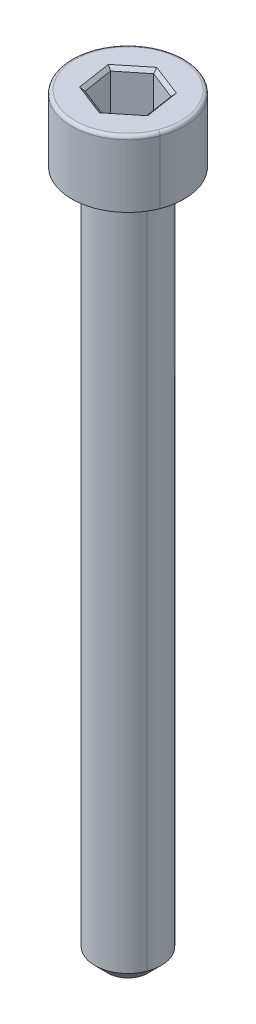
ISO-10303-21;
HEADER;
FILE_DESCRIPTION(('STEP AP214'),'2;1');
FILE_NAME('part.step','',(''),(''),'','','');
FILE_SCHEMA(('AUTOMOTIVE_DESIGN { 1 0 10303 214 1 1 1 1 }'));
ENDSEC;
DATA;
#1=APPLICATION_CONTEXT('core data for automotive mechanical design processes');
#2=APPLICATION_PROTOCOL_DEFINITION('international standard','automotive_design',2000,#1);
#3=PRODUCT_CONTEXT('',#1,'mechanical');
#4=PRODUCT('Part','Part','',(#3));
#5=PRODUCT_RELATED_PRODUCT_CATEGORY('part','',(#4));
#6=PRODUCT_DEFINITION_FORMATION('','',#4);
#7=PRODUCT_DEFINITION_CONTEXT('part definition',#1,'design');
#8=PRODUCT_DEFINITION('design','',#6,#7);
#9=PRODUCT_DEFINITION_SHAPE('','',#8);
#10=(LENGTH_UNIT() NAMED_UNIT(*) SI_UNIT(.MILLI.,.METRE.));
#11=(NAMED_UNIT(*) PLANE_ANGLE_UNIT() SI_UNIT($,.RADIAN.));
#12=(NAMED_UNIT(*) SI_UNIT($,.STERADIAN.) SOLID_ANGLE_UNIT());
#13=UNCERTAINTY_MEASURE_WITH_UNIT(LENGTH_MEASURE(1.E-05),#10,'distance_accuracy_value','');
#14=(GEOMETRIC_REPRESENTATION_CONTEXT(3) GLOBAL_UNCERTAINTY_ASSIGNED_CONTEXT((#13)) GLOBAL_UNIT_ASSIGNED_CONTEXT((#10,
#11,#12)) REPRESENTATION_CONTEXT('',''));
#15=CARTESIAN_POINT('',(0.,0.,0.));
#16=DIRECTION('',(0.,0.,1.));
#17=DIRECTION('',(1.,0.,0.));
#18=AXIS2_PLACEMENT_3D('',#15,#16,#17);
#19=CARTESIAN_POINT('',(-46.6986758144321,28.35,2.42348149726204));
#20=DIRECTION('',(-0.255193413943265,-0.707106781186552,0.659451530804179));
#21=DIRECTION('',(0.932605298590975,0.,0.360897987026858));
#22=AXIS2_PLACEMENT_3D('',#19,#20,#21);
#23=PLANE('',#22);
#24=DIRECTION('',(-0.588754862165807,0.654653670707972,0.474126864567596));
#25=VECTOR('',#24,1.);
#26=CARTESIAN_POINT('',(-46.6986758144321,28.35,2.42348149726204));
#27=LINE('',#26,#25);
#28=CARTESIAN_POINT('',(-46.6986758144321,28.35,2.42348149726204));
#29=VERTEX_POINT('',#28);
#30=CARTESIAN_POINT('',(-46.9235102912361,28.6,2.6045416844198));
#31=VERTEX_POINT('',#30);
#32=EDGE_CURVE('E25',#29,#31,#27,.T.);
#33=ORIENTED_EDGE('',*,*,#32,.T.);
#34=DIRECTION('',(-0.932605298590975,0.,-0.360897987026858));
#35=VECTOR('',#34,1.);
#36=CARTESIAN_POINT('',(-45.7120204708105,28.6,3.07336192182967));
#37=LINE('',#36,#35);
#38=CARTESIAN_POINT('',(-44.5005306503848,28.6,3.54218215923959));
#39=VERTEX_POINT('',#38);
#40=EDGE_CURVE('E345',#39,#31,#37,.T.);
#41=ORIENTED_EDGE('',*,*,#40,.F.);
#42=DIRECTION('',(-0.116228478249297,-0.654653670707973,-0.746940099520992));
#43=VECTOR('',#42,1.);
#44=CARTESIAN_POINT('',(-44.646368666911,27.7785714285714,2.60495692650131));
#45=LINE('',#44,#43);
#46=CARTESIAN_POINT('',(-44.5449161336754,28.35,3.25693969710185));
#47=VERTEX_POINT('',#46);
#48=EDGE_CURVE('E11',#39,#47,#45,.T.);
#49=ORIENTED_EDGE('',*,*,#48,.T.);
#50=DIRECTION('',(0.932605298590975,0.,0.360897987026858));
#51=VECTOR('',#50,1.);
#52=CARTESIAN_POINT('',(-46.6986758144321,28.35,2.42348149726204));
#53=LINE('',#52,#51);
#54=EDGE_CURVE('E317',#29,#47,#53,.T.);
#55=ORIENTED_EDGE('',*,*,#54,.F.);
#56=EDGE_LOOP('',(#33,#41,#49,#55));
#57=FACE_BOUND('',#56,.T.);
#58=ADVANCED_FACE('F16',(#57),#23,.F.);
#59=CARTESIAN_POINT('',(-44.5449161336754,28.35,3.25693969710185));
#60=DIRECTION('',(0.443505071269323,-0.707106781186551,0.550729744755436));
#61=DIRECTION('',(0.778849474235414,0.,-0.627210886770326));
#62=AXIS2_PLACEMENT_3D('',#59,#60,#61);
#63=PLANE('',#62);
#64=DIRECTION('',(-0.704983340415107,-0.654653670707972,-0.272813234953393));
#65=VECTOR('',#64,1.);
#66=CARTESIAN_POINT('',(-42.7462403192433,28.35,1.8084581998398));
#67=LINE('',#66,#65);
#68=CARTESIAN_POINT('',(-42.4770203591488,28.6,1.91264047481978));
#69=VERTEX_POINT('',#68);
#70=CARTESIAN_POINT('',(-42.7462403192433,28.35,1.8084581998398));
#71=VERTEX_POINT('',#70);
#72=EDGE_CURVE('E229',#69,#71,#67,.T.);
#73=ORIENTED_EDGE('',*,*,#72,.T.);
#74=DIRECTION('',(0.778849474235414,0.,-0.627210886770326));
#75=VECTOR('',#74,1.);
#76=CARTESIAN_POINT('',(-44.5449161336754,28.35,3.25693969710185));
#77=LINE('',#76,#75);
#78=EDGE_CURVE('E281',#47,#71,#77,.T.);
#79=ORIENTED_EDGE('',*,*,#78,.F.);
#80=ORIENTED_EDGE('',*,*,#48,.F.);
#81=DIRECTION('',(-0.778849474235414,0.,0.627210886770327));
#82=VECTOR('',#81,1.);
#83=CARTESIAN_POINT('',(-43.4887755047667,28.6,2.72741131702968));
#84=LINE('',#83,#82);
#85=EDGE_CURVE('E349',#69,#39,#84,.T.);
#86=ORIENTED_EDGE('',*,*,#85,.F.);
#87=EDGE_LOOP('',(#73,#79,#80,#86));
#88=FACE_BOUND('',#87,.T.);
#89=ADVANCED_FACE('F517',(#88),#63,.F.);
#90=CARTESIAN_POINT('',(-47.0537596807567,28.35,0.141541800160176));
#91=DIRECTION('',(-0.698698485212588,-0.707106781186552,0.108721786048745));
#92=DIRECTION('',(0.153755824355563,0.,0.988108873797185));
#93=AXIS2_PLACEMENT_3D('',#90,#91,#92);
#94=PLANE('',#93);
#95=DIRECTION('',(-0.704983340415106,0.654653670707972,-0.272813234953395));
#96=VECTOR('',#95,1.);
#97=CARTESIAN_POINT('',(-47.0537596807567,28.35,0.141541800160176));
#98=LINE('',#97,#96);
#99=CARTESIAN_POINT('',(-47.0537596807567,28.35,0.141541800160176));
#100=VERTEX_POINT('',#99);
#101=CARTESIAN_POINT('',(-47.3229796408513,28.6,0.0373595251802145));
#102=VERTEX_POINT('',#101);
#103=EDGE_CURVE('E217',#100,#102,#98,.T.);
#104=ORIENTED_EDGE('',*,*,#103,.T.);
#105=DIRECTION('',(-0.153755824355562,0.,-0.988108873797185));
#106=VECTOR('',#105,1.);
#107=CARTESIAN_POINT('',(-47.1232449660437,28.6,1.3209506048));
#108=LINE('',#107,#106);
#109=EDGE_CURVE('E341',#31,#102,#108,.T.);
#110=ORIENTED_EDGE('',*,*,#109,.F.);
#111=ORIENTED_EDGE('',*,*,#32,.F.);
#112=DIRECTION('',(0.153755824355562,0.,0.988108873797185));
#113=VECTOR('',#112,1.);
#114=CARTESIAN_POINT('',(-47.0537596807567,28.35,0.141541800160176));
#115=LINE('',#114,#113);
#116=EDGE_CURVE('E241',#100,#29,#115,.T.);
#117=ORIENTED_EDGE('',*,*,#116,.F.);
#118=EDGE_LOOP('',(#104,#110,#111,#117));
#119=FACE_BOUND('',#118,.T.);
#120=ADVANCED_FACE('F312',(#119),#94,.F.);
#121=CARTESIAN_POINT('',(-42.7462403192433,28.35,1.8084581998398));
#122=DIRECTION('',(0.698698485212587,-0.707106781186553,-0.108721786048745));
#123=DIRECTION('',(-0.153755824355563,0.,-0.988108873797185));
#124=AXIS2_PLACEMENT_3D('',#121,#122,#123);
#125=PLANE('',#124);
#126=DIRECTION('',(-0.588754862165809,-0.654653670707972,0.474126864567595));
#127=VECTOR('',#126,1.);
#128=CARTESIAN_POINT('',(-43.1013241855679,28.35,-0.473481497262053));
#129=LINE('',#128,#127);
#130=CARTESIAN_POINT('',(-42.8764897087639,28.6,-0.654541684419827));
#131=VERTEX_POINT('',#130);
#132=CARTESIAN_POINT('',(-43.1013241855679,28.35,-0.473481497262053));
#133=VERTEX_POINT('',#132);
#134=EDGE_CURVE('E205',#131,#133,#129,.T.);
#135=ORIENTED_EDGE('',*,*,#134,.T.);
#136=DIRECTION('',(-0.153755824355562,0.,-0.988108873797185));
#137=VECTOR('',#136,1.);
#138=CARTESIAN_POINT('',(-42.7462403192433,28.35,1.8084581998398));
#139=LINE('',#138,#137);
#140=EDGE_CURVE('E274',#71,#133,#139,.T.);
#141=ORIENTED_EDGE('',*,*,#140,.F.);
#142=ORIENTED_EDGE('',*,*,#72,.F.);
#143=DIRECTION('',(0.153755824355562,0.,0.988108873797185));
#144=VECTOR('',#143,1.);
#145=CARTESIAN_POINT('',(-42.6767550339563,28.6,0.629049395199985));
#146=LINE('',#145,#144);
#147=EDGE_CURVE('E327',#131,#69,#146,.T.);
#148=ORIENTED_EDGE('',*,*,#147,.F.);
#149=EDGE_LOOP('',(#135,#141,#142,#148));
#150=FACE_BOUND('',#149,.T.);
#151=ADVANCED_FACE('F525',(#150),#125,.F.);
#152=CARTESIAN_POINT('',(-45.2550838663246,28.35,-1.30693969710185));
#153=DIRECTION('',(-0.443505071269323,-0.707106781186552,-0.550729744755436));
#154=DIRECTION('',(-0.778849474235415,0.,0.627210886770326));
#155=AXIS2_PLACEMENT_3D('',#152,#153,#154);
#156=PLANE('',#155);
#157=DIRECTION('',(-0.116228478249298,0.654653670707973,-0.746940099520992));
#158=VECTOR('',#157,1.);
#159=CARTESIAN_POINT('',(-45.2550838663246,28.35,-1.30693969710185));
#160=LINE('',#159,#158);
#161=CARTESIAN_POINT('',(-45.2550838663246,28.35,-1.30693969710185));
#162=VERTEX_POINT('',#161);
#163=CARTESIAN_POINT('',(-45.2994693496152,28.6,-1.5921821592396));
#164=VERTEX_POINT('',#163);
#165=EDGE_CURVE('E210',#162,#164,#160,.T.);
#166=ORIENTED_EDGE('',*,*,#165,.T.);
#167=DIRECTION('',(0.778849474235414,0.,-0.627210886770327));
#168=VECTOR('',#167,1.);
#169=CARTESIAN_POINT('',(-46.3112244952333,28.6,-0.777411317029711));
#170=LINE('',#169,#168);
#171=EDGE_CURVE('E337',#102,#164,#170,.T.);
#172=ORIENTED_EDGE('',*,*,#171,.F.);
#173=ORIENTED_EDGE('',*,*,#103,.F.);
#174=DIRECTION('',(-0.778849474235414,0.,0.627210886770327));
#175=VECTOR('',#174,1.);
#176=CARTESIAN_POINT('',(-45.2550838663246,28.35,-1.30693969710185));
#177=LINE('',#176,#175);
#178=EDGE_CURVE('E250',#162,#100,#177,.T.);
#179=ORIENTED_EDGE('',*,*,#178,.F.);
#180=EDGE_LOOP('',(#166,#172,#173,#179));
#181=FACE_BOUND('',#180,.T.);
#182=ADVANCED_FACE('F530',(#181),#156,.F.);
#183=CARTESIAN_POINT('',(-43.1013241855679,28.35,-0.473481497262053));
#184=DIRECTION('',(0.255193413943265,-0.707106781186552,-0.659451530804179));
#185=DIRECTION('',(-0.932605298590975,0.,-0.360897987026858));
#186=AXIS2_PLACEMENT_3D('',#183,#184,#185);
#187=PLANE('',#186);
#188=ORIENTED_EDGE('',*,*,#134,.F.);
#189=DIRECTION('',(0.932605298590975,0.,0.360897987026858));
#190=VECTOR('',#189,1.);
#191=CARTESIAN_POINT('',(-44.0879795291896,28.6,-1.12336192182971));
#192=LINE('',#191,#190);
#193=EDGE_CURVE('E331',#164,#131,#192,.T.);
#194=ORIENTED_EDGE('',*,*,#193,.F.);
#195=ORIENTED_EDGE('',*,*,#165,.F.);
#196=DIRECTION('',(-0.932605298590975,0.,-0.360897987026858));
#197=VECTOR('',#196,1.);
#198=CARTESIAN_POINT('',(-43.1013241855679,28.35,-0.473481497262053));
#199=LINE('',#198,#197);
#200=EDGE_CURVE('E262',#133,#162,#199,.T.);
#201=ORIENTED_EDGE('',*,*,#200,.F.);
#202=EDGE_LOOP('',(#188,#194,#195,#201));
#203=FACE_BOUND('',#202,.T.);
#204=ADVANCED_FACE('F531',(#203),#187,.F.);
#205=CARTESIAN_POINT('',(-46.8969569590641,25.35,0.336254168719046));
#206=DIRECTION('',(-0.778849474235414,0.,0.627210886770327));
#207=DIRECTION('',(-0.627210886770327,0.,-0.778849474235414));
#208=AXIS2_PLACEMENT_3D('',#205,#206,#207);
#209=CYLINDRICAL_SURFACE('',#208,0.25);
#210=CARTESIAN_POINT('',(-45.210698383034,25.1,-1.02169723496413));
#211=CARTESIAN_POINT('',(-45.2366987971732,25.1,-1.18878840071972));
#212=CARTESIAN_POINT('',(-45.2550838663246,25.2035533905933,-1.30693969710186));
#213=CARTESIAN_POINT('',(-45.2550838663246,25.35,-1.30693969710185));
#214=(BOUNDED_CURVE() B_SPLINE_CURVE(3,(#210,#211,#212,#213),.UNSPECIFIED.,.F.,
.F.) B_SPLINE_CURVE_WITH_KNOTS((4,4),(1.5707963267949,3.1415926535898),
.UNSPECIFIED.) CURVE() GEOMETRIC_REPRESENTATION_ITEM() RATIONAL_B_SPLINE_CURVE((1.,
0.804737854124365,0.804737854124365,1.)) REPRESENTATION_ITEM(''));
#215=CARTESIAN_POINT('',(-45.210698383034,25.1,-1.02169723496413));
#216=VERTEX_POINT('',#215);
#217=CARTESIAN_POINT('',(-45.2550838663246,25.35,-1.30693969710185));
#218=VERTEX_POINT('',#217);
#219=EDGE_CURVE('E136',#216,#218,#214,.T.);
#220=ORIENTED_EDGE('',*,*,#219,.T.);
#221=DIRECTION('',(0.778849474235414,0.,-0.627210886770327));
#222=VECTOR('',#221,1.);
#223=CARTESIAN_POINT('',(-45.2550838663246,25.35,-1.30693969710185));
#224=LINE('',#223,#222);
#225=CARTESIAN_POINT('',(-47.0537596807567,25.35,0.141541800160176));
#226=VERTEX_POINT('',#225);
#227=EDGE_CURVE('E254',#226,#218,#224,.T.);
#228=ORIENTED_EDGE('',*,*,#227,.F.);
#229=CARTESIAN_POINT('',(-47.0537596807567,25.35,0.141541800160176));
#230=CARTESIAN_POINT('',(-47.0537596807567,25.2035533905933,0.14154180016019));
#231=CARTESIAN_POINT('',(-46.942245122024,25.1,0.184695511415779));
#232=CARTESIAN_POINT('',(-46.7845397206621,25.1,0.245724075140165));
#233=(BOUNDED_CURVE() B_SPLINE_CURVE(3,(#229,#230,#231,#232),.UNSPECIFIED.,.F.,
.F.) B_SPLINE_CURVE_WITH_KNOTS((4,4),(0.,1.5707963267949),
.UNSPECIFIED.) CURVE() GEOMETRIC_REPRESENTATION_ITEM() RATIONAL_B_SPLINE_CURVE((1.,
0.804737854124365,0.804737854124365,1.)) REPRESENTATION_ITEM(''));
#234=CARTESIAN_POINT('',(-46.7845397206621,25.1,0.245724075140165));
#235=VERTEX_POINT('',#234);
#236=EDGE_CURVE('E198',#226,#235,#233,.T.);
#237=ORIENTED_EDGE('',*,*,#236,.T.);
#238=DIRECTION('',(-0.778849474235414,0.,0.627210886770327));
#239=VECTOR('',#238,1.);
#240=CARTESIAN_POINT('',(-46.8969569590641,25.1,0.336254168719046));
#241=LINE('',#240,#239);
#242=EDGE_CURVE('E151',#216,#235,#241,.T.);
#243=ORIENTED_EDGE('',*,*,#242,.F.);
#244=EDGE_LOOP('',(#220,#228,#237,#243));
#245=FACE_BOUND('',#244,.T.);
#246=ADVANCED_FACE('F299',(#245),#209,.F.);
#247=CARTESIAN_POINT('',(-46.2741066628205,25.35,3.52601238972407));
#248=DIRECTION('',(0.153755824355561,0.,0.988108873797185));
#249=DIRECTION('',(-0.988108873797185,0.,0.153755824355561));
#250=AXIS2_PLACEMENT_3D('',#247,#248,#249);
#251=CYLINDRICAL_SURFACE('',#250,0.25);
#252=CARTESIAN_POINT('',(-46.6986758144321,25.35,2.42348149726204));
#253=CARTESIAN_POINT('',(-46.6986758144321,25.2035533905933,2.42348149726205));
#254=CARTESIAN_POINT('',(-46.6055463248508,25.1,2.3484839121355));
#255=CARTESIAN_POINT('',(-46.4738413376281,25.1,2.2424213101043));
#256=(BOUNDED_CURVE() B_SPLINE_CURVE(3,(#252,#253,#254,#255),.UNSPECIFIED.,.F.,
.F.) B_SPLINE_CURVE_WITH_KNOTS((4,4),(0.,1.5707963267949),
.UNSPECIFIED.) CURVE() GEOMETRIC_REPRESENTATION_ITEM() RATIONAL_B_SPLINE_CURVE((1.,
0.804737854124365,0.804737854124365,1.)) REPRESENTATION_ITEM(''));
#257=CARTESIAN_POINT('',(-46.6986758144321,25.35,2.42348149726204));
#258=VERTEX_POINT('',#257);
#259=CARTESIAN_POINT('',(-46.4738413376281,25.1,2.2424213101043));
#260=VERTEX_POINT('',#259);
#261=EDGE_CURVE('E124',#258,#260,#256,.T.);
#262=ORIENTED_EDGE('',*,*,#261,.T.);
#263=DIRECTION('',(0.153755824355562,0.,0.988108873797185));
#264=VECTOR('',#263,1.);
#265=CARTESIAN_POINT('',(-46.2741066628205,25.1,3.52601238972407));
#266=LINE('',#265,#264);
#267=EDGE_CURVE('E128',#235,#260,#266,.T.);
#268=ORIENTED_EDGE('',*,*,#267,.F.);
#269=ORIENTED_EDGE('',*,*,#236,.F.);
#270=DIRECTION('',(-0.153755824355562,0.,-0.988108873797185));
#271=VECTOR('',#270,1.);
#272=CARTESIAN_POINT('',(-47.0537596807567,25.35,0.141541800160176));
#273=LINE('',#272,#271);
#274=EDGE_CURVE('E131',#258,#226,#273,.T.);
#275=ORIENTED_EDGE('',*,*,#274,.F.);
#276=EDGE_LOOP('',(#262,#268,#269,#275));
#277=FACE_BOUND('',#276,.T.);
#278=ADVANCED_FACE('F126',(#277),#251,.F.);
#279=CARTESIAN_POINT('',(-43.1915486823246,25.35,-0.240330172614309));
#280=DIRECTION('',(-0.932605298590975,0.,-0.360897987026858));
#281=DIRECTION('',(0.360897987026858,0.,-0.932605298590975));
#282=AXIS2_PLACEMENT_3D('',#279,#280,#281);
#283=CYLINDRICAL_SURFACE('',#282,0.25);
#284=CARTESIAN_POINT('',(-43.3261586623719,25.1,-0.292421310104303));
#285=CARTESIAN_POINT('',(-43.1944536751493,25.1,-0.398483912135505));
#286=CARTESIAN_POINT('',(-43.101324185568,25.2035533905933,-0.473481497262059));
#287=CARTESIAN_POINT('',(-43.1013241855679,25.35,-0.473481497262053));
#288=(BOUNDED_CURVE() B_SPLINE_CURVE(3,(#284,#285,#286,#287),.UNSPECIFIED.,.F.,
.F.) B_SPLINE_CURVE_WITH_KNOTS((4,4),(4.71238898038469,6.28318530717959),
.UNSPECIFIED.) CURVE() GEOMETRIC_REPRESENTATION_ITEM() RATIONAL_B_SPLINE_CURVE((1.,
0.804737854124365,0.804737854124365,1.)) REPRESENTATION_ITEM(''));
#289=CARTESIAN_POINT('',(-43.3261586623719,25.1,-0.292421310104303));
#290=VERTEX_POINT('',#289);
#291=CARTESIAN_POINT('',(-43.1013241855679,25.35,-0.473481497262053));
#292=VERTEX_POINT('',#291);
#293=EDGE_CURVE('E137',#290,#292,#288,.T.);
#294=ORIENTED_EDGE('',*,*,#293,.T.);
#295=DIRECTION('',(0.932605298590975,0.,0.360897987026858));
#296=VECTOR('',#295,1.);
#297=CARTESIAN_POINT('',(-43.1013241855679,25.35,-0.473481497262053));
#298=LINE('',#297,#296);
#299=EDGE_CURVE('E266',#218,#292,#298,.T.);
#300=ORIENTED_EDGE('',*,*,#299,.F.);
#301=ORIENTED_EDGE('',*,*,#219,.F.);
#302=DIRECTION('',(-0.932605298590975,0.,-0.360897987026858));
#303=VECTOR('',#302,1.);
#304=CARTESIAN_POINT('',(-43.1915486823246,25.1,-0.240330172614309));
#305=LINE('',#304,#303);
#306=EDGE_CURVE('E157',#290,#216,#305,.T.);
#307=ORIENTED_EDGE('',*,*,#306,.F.);
#308=EDGE_LOOP('',(#294,#300,#301,#307));
#309=FACE_BOUND('',#308,.T.);
#310=ADVANCED_FACE('F294',(#309),#283,.F.);
#311=CARTESIAN_POINT('',(-44.4546916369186,25.35,3.02378837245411));
#312=DIRECTION('',(0.932605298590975,0.,0.360897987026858));
#313=DIRECTION('',(0.,-1.,0.));
#314=AXIS2_PLACEMENT_3D('',#311,#312,#313);
#315=CYLINDRICAL_SURFACE('',#314,0.25);
#316=CARTESIAN_POINT('',(-44.5449161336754,25.35,3.25693969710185));
#317=CARTESIAN_POINT('',(-44.5449161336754,25.2035533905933,3.25693969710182));
#318=CARTESIAN_POINT('',(-44.5633012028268,25.1,3.13878840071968));
#319=CARTESIAN_POINT('',(-44.589301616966,25.1,2.9716972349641));
#320=(BOUNDED_CURVE() B_SPLINE_CURVE(3,(#316,#317,#318,#319),.UNSPECIFIED.,.F.,
.F.) B_SPLINE_CURVE_WITH_KNOTS((4,4),(0.,1.5707963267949),
.UNSPECIFIED.) CURVE() GEOMETRIC_REPRESENTATION_ITEM() RATIONAL_B_SPLINE_CURVE((1.,
0.804737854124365,0.804737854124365,1.)) REPRESENTATION_ITEM(''));
#321=CARTESIAN_POINT('',(-44.5449161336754,25.35,3.25693969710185));
#322=VERTEX_POINT('',#321);
#323=CARTESIAN_POINT('',(-44.589301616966,25.1,2.9716972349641));
#324=VERTEX_POINT('',#323);
#325=EDGE_CURVE('E142',#322,#324,#320,.T.);
#326=ORIENTED_EDGE('',*,*,#325,.T.);
#327=DIRECTION('',(0.932605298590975,0.,0.360897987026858));
#328=VECTOR('',#327,1.);
#329=CARTESIAN_POINT('',(-44.4546916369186,25.1,3.02378837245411));
#330=LINE('',#329,#328);
#331=EDGE_CURVE('E140',#260,#324,#330,.T.);
#332=ORIENTED_EDGE('',*,*,#331,.F.);
#333=ORIENTED_EDGE('',*,*,#261,.F.);
#334=DIRECTION('',(-0.932605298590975,0.,-0.360897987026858));
#335=VECTOR('',#334,1.);
#336=CARTESIAN_POINT('',(-46.6986758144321,25.35,2.42348149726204));
#337=LINE('',#336,#335);
#338=EDGE_CURVE('E235',#322,#258,#337,.T.);
#339=ORIENTED_EDGE('',*,*,#338,.F.);
#340=EDGE_LOOP('',(#326,#332,#333,#339));
#341=FACE_BOUND('',#340,.T.);
#342=ADVANCED_FACE('F141',(#341),#315,.F.);
#343=CARTESIAN_POINT('',(-42.8157256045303,25.35,2.98786700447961));
#344=DIRECTION('',(-0.153755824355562,0.,-0.988108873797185));
#345=DIRECTION('',(0.988108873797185,0.,-0.153755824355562));
#346=AXIS2_PLACEMENT_3D('',#343,#344,#345);
#347=CYLINDRICAL_SURFACE('',#346,0.25);
#348=CARTESIAN_POINT('',(-43.0154602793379,25.1,1.70427592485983));
#349=CARTESIAN_POINT('',(-42.8577548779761,25.1,1.76530448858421));
#350=CARTESIAN_POINT('',(-42.7462403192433,25.2035533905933,1.8084581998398));
#351=CARTESIAN_POINT('',(-42.7462403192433,25.35,1.8084581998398));
#352=(BOUNDED_CURVE() B_SPLINE_CURVE(3,(#348,#349,#350,#351),.UNSPECIFIED.,.F.,
.F.) B_SPLINE_CURVE_WITH_KNOTS((4,4),(4.71238898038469,6.28318530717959),
.UNSPECIFIED.) CURVE() GEOMETRIC_REPRESENTATION_ITEM() RATIONAL_B_SPLINE_CURVE((1.,
0.804737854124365,0.804737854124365,1.)) REPRESENTATION_ITEM(''));
#353=CARTESIAN_POINT('',(-43.0154602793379,25.1,1.70427592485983));
#354=VERTEX_POINT('',#353);
#355=CARTESIAN_POINT('',(-42.7462403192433,25.35,1.8084581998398));
#356=VERTEX_POINT('',#355);
#357=EDGE_CURVE('E37',#354,#356,#352,.T.);
#358=ORIENTED_EDGE('',*,*,#357,.T.);
#359=DIRECTION('',(0.153755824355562,0.,0.988108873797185));
#360=VECTOR('',#359,1.);
#361=CARTESIAN_POINT('',(-42.7462403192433,25.35,1.8084581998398));
#362=LINE('',#361,#360);
#363=EDGE_CURVE('E277',#292,#356,#362,.T.);
#364=ORIENTED_EDGE('',*,*,#363,.F.);
#365=ORIENTED_EDGE('',*,*,#293,.F.);
#366=DIRECTION('',(-0.153755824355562,0.,-0.988108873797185));
#367=VECTOR('',#366,1.);
#368=CARTESIAN_POINT('',(-42.8157256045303,25.1,2.98786700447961));
#369=LINE('',#368,#367);
#370=EDGE_CURVE('E164',#354,#290,#369,.T.);
#371=ORIENTED_EDGE('',*,*,#370,.F.);
#372=EDGE_LOOP('',(#358,#364,#365,#371));
#373=FACE_BOUND('',#372,.T.);
#374=ADVANCED_FACE('F543',(#373),#347,.F.);
#375=CARTESIAN_POINT('',(-44.701718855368,25.35,3.06222732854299));
#376=DIRECTION('',(0.778849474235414,0.,-0.627210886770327));
#377=DIRECTION('',(0.627210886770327,0.,0.778849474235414));
#378=AXIS2_PLACEMENT_3D('',#375,#376,#377);
#379=CYLINDRICAL_SURFACE('',#378,0.25);
#380=ORIENTED_EDGE('',*,*,#325,.F.);
#381=DIRECTION('',(-0.778849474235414,0.,0.627210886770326));
#382=VECTOR('',#381,1.);
#383=CARTESIAN_POINT('',(-44.5449161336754,25.35,3.25693969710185));
#384=LINE('',#383,#382);
#385=EDGE_CURVE('E284',#356,#322,#384,.T.);
#386=ORIENTED_EDGE('',*,*,#385,.F.);
#387=ORIENTED_EDGE('',*,*,#357,.F.);
#388=DIRECTION('',(0.778849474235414,0.,-0.627210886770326));
#389=VECTOR('',#388,1.);
#390=CARTESIAN_POINT('',(-44.701718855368,25.1,3.06222732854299));
#391=LINE('',#390,#389);
#392=EDGE_CURVE('E146',#324,#354,#391,.T.);
#393=ORIENTED_EDGE('',*,*,#392,.F.);
#394=EDGE_LOOP('',(#380,#386,#387,#393));
#395=FACE_BOUND('',#394,.T.);
#396=ADVANCED_FACE('F546',(#395),#379,.F.);
#397=CARTESIAN_POINT('',(-44.9,28.35,0.975));
#398=DIRECTION('',(0.,-1.,0.));
#399=DIRECTION('',(-0.932605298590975,0.,-0.360897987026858));
#400=AXIS2_PLACEMENT_3D('',#397,#398,#399);
#401=TOROIDAL_SURFACE('',#400,4.,0.25);
#402=CARTESIAN_POINT('',(-41.1695788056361,28.35,2.41859194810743));
#403=DIRECTION('',(0.360897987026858,0.,-0.932605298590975));
#404=DIRECTION('',(0.932605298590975,0.,0.360897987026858));
#405=AXIS2_PLACEMENT_3D('',#402,#403,#404);
#406=CIRCLE('',#405,0.25);
#407=CARTESIAN_POINT('',(-41.1695788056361,28.6,2.41859194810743));
#408=VERTEX_POINT('',#407);
#409=CARTESIAN_POINT('',(-40.9364274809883,28.35,2.50881644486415));
#410=VERTEX_POINT('',#409);
#411=EDGE_CURVE('E421',#408,#410,#406,.T.);
#412=ORIENTED_EDGE('',*,*,#411,.F.);
#413=CARTESIAN_POINT('',(-44.9,28.6,0.975));
#414=DIRECTION('',(0.,1.,0.));
#415=DIRECTION('',(-0.932605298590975,0.,-0.360897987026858));
#416=AXIS2_PLACEMENT_3D('',#413,#414,#415);
#417=CIRCLE('',#416,4.);
#418=CARTESIAN_POINT('',(-48.6304211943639,28.6,-0.468591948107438));
#419=VERTEX_POINT('',#418);
#420=EDGE_CURVE('E353',#419,#408,#417,.T.);
#421=ORIENTED_EDGE('',*,*,#420,.F.);
#422=CARTESIAN_POINT('',(-48.6304211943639,28.35,-0.468591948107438));
#423=DIRECTION('',(-0.360897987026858,0.,0.932605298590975));
#424=DIRECTION('',(0.,1.,0.));
#425=AXIS2_PLACEMENT_3D('',#422,#423,#424);
#426=CIRCLE('',#425,0.25);
#427=CARTESIAN_POINT('',(-48.8635725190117,28.35,-0.558816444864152));
#428=VERTEX_POINT('',#427);
#429=EDGE_CURVE('E411',#419,#428,#426,.T.);
#430=ORIENTED_EDGE('',*,*,#429,.T.);
#431=CARTESIAN_POINT('',(-44.9,28.35,0.975));
#432=DIRECTION('',(0.,-1.,0.));
#433=DIRECTION('',(-0.932605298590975,0.,-0.360897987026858));
#434=AXIS2_PLACEMENT_3D('',#431,#432,#433);
#435=CIRCLE('',#434,4.25);
#436=EDGE_CURVE('E356',#410,#428,#435,.T.);
#437=ORIENTED_EDGE('',*,*,#436,.F.);
#438=EDGE_LOOP('',(#412,#421,#430,#437));
#439=FACE_BOUND('',#438,.T.);
#440=ADVANCED_FACE('F550',(#439),#401,.T.);
#441=CARTESIAN_POINT('',(-44.9,-28.4,0.975));
#442=DIRECTION('',(0.,1.,0.));
#443=DIRECTION('',(0.932605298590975,0.,0.360897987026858));
#444=AXIS2_PLACEMENT_3D('',#441,#442,#443);
#445=CONICAL_SURFACE('',#444,1.50000000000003,0.785398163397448);
#446=DIRECTION('',(-0.659451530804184,0.707106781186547,-0.255193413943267));
#447=VECTOR('',#446,1.);
#448=CARTESIAN_POINT('',(-46.2989079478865,-28.4,0.433653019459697));
#449=LINE('',#448,#447);
#450=CARTESIAN_POINT('',(-46.2989079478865,-28.4,0.433653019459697));
#451=VERTEX_POINT('',#450);
#452=CARTESIAN_POINT('',(-47.2315132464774,-27.4,0.0727550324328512));
#453=VERTEX_POINT('',#452);
#454=EDGE_CURVE('E403',#451,#453,#449,.T.);
#455=ORIENTED_EDGE('',*,*,#454,.F.);
#456=CARTESIAN_POINT('',(-44.9,-28.4,0.975));
#457=DIRECTION('',(0.,-1.,0.));
#458=DIRECTION('',(-0.932605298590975,0.,-0.360897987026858));
#459=AXIS2_PLACEMENT_3D('',#456,#457,#458);
#460=CIRCLE('',#459,1.50000000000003);
#461=CARTESIAN_POINT('',(-43.5010920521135,-28.4,1.5163469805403));
#462=VERTEX_POINT('',#461);
#463=EDGE_CURVE('E365',#462,#451,#460,.T.);
#464=ORIENTED_EDGE('',*,*,#463,.F.);
#465=DIRECTION('',(0.659451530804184,0.707106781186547,0.255193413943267));
#466=VECTOR('',#465,1.);
#467=CARTESIAN_POINT('',(-43.5010920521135,-28.4,1.5163469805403));
#468=LINE('',#467,#466);
#469=CARTESIAN_POINT('',(-42.5684867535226,-27.4,1.87724496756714));
#470=VERTEX_POINT('',#469);
#471=EDGE_CURVE('E395',#462,#470,#468,.T.);
#472=ORIENTED_EDGE('',*,*,#471,.T.);
#473=CARTESIAN_POINT('',(-44.9,-27.4,0.975));
#474=DIRECTION('',(0.,1.,0.));
#475=DIRECTION('',(-0.932605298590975,0.,-0.360897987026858));
#476=AXIS2_PLACEMENT_3D('',#473,#474,#475);
#477=CIRCLE('',#476,2.5);
#478=EDGE_CURVE('E370',#453,#470,#477,.T.);
#479=ORIENTED_EDGE('',*,*,#478,.F.);
#480=EDGE_LOOP('',(#455,#464,#472,#479));
#481=FACE_BOUND('',#480,.T.);
#482=ADVANCED_FACE('F553',(#481),#445,.T.);
#483=CARTESIAN_POINT('',(-44.5449161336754,25.1,3.25693969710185));
#484=DIRECTION('',(0.,1.,0.));
#485=DIRECTION('',(-0.360897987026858,0.,0.932605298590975));
#486=AXIS2_PLACEMENT_3D('',#483,#484,#485);
#487=PLANE('',#486);
#488=ORIENTED_EDGE('',*,*,#306,.T.);
#489=ORIENTED_EDGE('',*,*,#242,.T.);
#490=ORIENTED_EDGE('',*,*,#267,.T.);
#491=ORIENTED_EDGE('',*,*,#331,.T.);
#492=ORIENTED_EDGE('',*,*,#392,.T.);
#493=ORIENTED_EDGE('',*,*,#370,.T.);
#494=EDGE_LOOP('',(#488,#489,#490,#491,#492,#493));
#495=FACE_BOUND('',#494,.T.);
#496=ADVANCED_FACE('F149',(#495),#487,.T.);
#497=CARTESIAN_POINT('',(-44.5449161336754,25.1,3.25693969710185));
#498=DIRECTION('',(0.627210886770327,0.,0.778849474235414));
#499=DIRECTION('',(0.778849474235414,0.,-0.627210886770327));
#500=AXIS2_PLACEMENT_3D('',#497,#498,#499);
#501=PLANE('',#500);
#502=DIRECTION('',(0.,1.,0.));
#503=VECTOR('',#502,1.);
#504=CARTESIAN_POINT('',(-44.5449161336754,25.1,3.25693969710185));
#505=LINE('',#504,#503);
#506=EDGE_CURVE('E233',#322,#47,#505,.T.);
#507=ORIENTED_EDGE('',*,*,#506,.T.);
#508=ORIENTED_EDGE('',*,*,#78,.T.);
#509=DIRECTION('',(0.,1.,0.));
#510=VECTOR('',#509,1.);
#511=CARTESIAN_POINT('',(-42.7462403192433,25.1,1.8084581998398));
#512=LINE('',#511,#510);
#513=EDGE_CURVE('E270',#356,#71,#512,.T.);
#514=ORIENTED_EDGE('',*,*,#513,.F.);
#515=ORIENTED_EDGE('',*,*,#385,.T.);
#516=EDGE_LOOP('',(#507,#508,#514,#515));
#517=FACE_BOUND('',#516,.T.);
#518=ADVANCED_FACE('F558',(#517),#501,.F.);
#519=CARTESIAN_POINT('',(-42.7462403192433,25.1,1.8084581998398));
#520=DIRECTION('',(0.988108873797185,0.,-0.153755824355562));
#521=DIRECTION('',(0.,-1.,0.));
#522=AXIS2_PLACEMENT_3D('',#519,#520,#521);
#523=PLANE('',#522);
#524=ORIENTED_EDGE('',*,*,#513,.T.);
#525=ORIENTED_EDGE('',*,*,#140,.T.);
#526=DIRECTION('',(0.,1.,0.));
#527=VECTOR('',#526,1.);
#528=CARTESIAN_POINT('',(-43.1013241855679,25.1,-0.473481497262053));
#529=LINE('',#528,#527);
#530=EDGE_CURVE('E258',#292,#133,#529,.T.);
#531=ORIENTED_EDGE('',*,*,#530,.F.);
#532=ORIENTED_EDGE('',*,*,#363,.T.);
#533=EDGE_LOOP('',(#524,#525,#531,#532));
#534=FACE_BOUND('',#533,.T.);
#535=ADVANCED_FACE('F561',(#534),#523,.F.);
#536=CARTESIAN_POINT('',(-43.1013241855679,25.1,-0.473481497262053));
#537=DIRECTION('',(0.360897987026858,0.,-0.932605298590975));
#538=DIRECTION('',(-0.932605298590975,0.,-0.360897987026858));
#539=AXIS2_PLACEMENT_3D('',#536,#537,#538);
#540=PLANE('',#539);
#541=ORIENTED_EDGE('',*,*,#530,.T.);
#542=ORIENTED_EDGE('',*,*,#200,.T.);
#543=DIRECTION('',(0.,1.,0.));
#544=VECTOR('',#543,1.);
#545=CARTESIAN_POINT('',(-45.2550838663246,25.1,-1.30693969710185));
#546=LINE('',#545,#544);
#547=EDGE_CURVE('E249',#218,#162,#546,.T.);
#548=ORIENTED_EDGE('',*,*,#547,.F.);
#549=ORIENTED_EDGE('',*,*,#299,.T.);
#550=EDGE_LOOP('',(#541,#542,#548,#549));
#551=FACE_BOUND('',#550,.T.);
#552=ADVANCED_FACE('F562',(#551),#540,.F.);
#553=CARTESIAN_POINT('',(-45.2550838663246,25.1,-1.30693969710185));
#554=DIRECTION('',(-0.627210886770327,0.,-0.778849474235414));
#555=DIRECTION('',(0.,1.,0.));
#556=AXIS2_PLACEMENT_3D('',#553,#554,#555);
#557=PLANE('',#556);
#558=ORIENTED_EDGE('',*,*,#547,.T.);
#559=ORIENTED_EDGE('',*,*,#178,.T.);
#560=DIRECTION('',(0.,1.,0.));
#561=VECTOR('',#560,1.);
#562=CARTESIAN_POINT('',(-47.0537596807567,25.1,0.141541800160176));
#563=LINE('',#562,#561);
#564=EDGE_CURVE('E236',#226,#100,#563,.T.);
#565=ORIENTED_EDGE('',*,*,#564,.F.);
#566=ORIENTED_EDGE('',*,*,#227,.T.);
#567=EDGE_LOOP('',(#558,#559,#565,#566));
#568=FACE_BOUND('',#567,.T.);
#569=ADVANCED_FACE('F309',(#568),#557,.F.);
#570=CARTESIAN_POINT('',(-47.0537596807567,25.1,0.141541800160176));
#571=DIRECTION('',(-0.988108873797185,0.,0.153755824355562));
#572=DIRECTION('',(0.,1.,0.));
#573=AXIS2_PLACEMENT_3D('',#570,#571,#572);
#574=PLANE('',#573);
#575=ORIENTED_EDGE('',*,*,#564,.T.);
#576=ORIENTED_EDGE('',*,*,#116,.T.);
#577=DIRECTION('',(0.,1.,0.));
#578=VECTOR('',#577,1.);
#579=CARTESIAN_POINT('',(-46.6986758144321,25.1,2.42348149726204));
#580=LINE('',#579,#578);
#581=EDGE_CURVE('E308',#258,#29,#580,.T.);
#582=ORIENTED_EDGE('',*,*,#581,.F.);
#583=ORIENTED_EDGE('',*,*,#274,.T.);
#584=EDGE_LOOP('',(#575,#576,#582,#583));
#585=FACE_BOUND('',#584,.T.);
#586=ADVANCED_FACE('F306',(#585),#574,.F.);
#587=CARTESIAN_POINT('',(-46.6986758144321,25.1,2.42348149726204));
#588=DIRECTION('',(-0.360897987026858,0.,0.932605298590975));
#589=DIRECTION('',(0.,1.,0.));
#590=AXIS2_PLACEMENT_3D('',#587,#588,#589);
#591=PLANE('',#590);
#592=ORIENTED_EDGE('',*,*,#581,.T.);
#593=ORIENTED_EDGE('',*,*,#54,.T.);
#594=ORIENTED_EDGE('',*,*,#506,.F.);
#595=ORIENTED_EDGE('',*,*,#338,.T.);
#596=EDGE_LOOP('',(#592,#593,#594,#595));
#597=FACE_BOUND('',#596,.T.);
#598=ADVANCED_FACE('F325',(#597),#591,.F.);
#599=CARTESIAN_POINT('',(-44.9,28.6,0.975));
#600=DIRECTION('',(0.,-1.,0.));
#601=DIRECTION('',(-0.932605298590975,0.,-0.360897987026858));
#602=AXIS2_PLACEMENT_3D('',#599,#600,#601);
#603=PLANE('',#602);
#604=ORIENTED_EDGE('',*,*,#85,.T.);
#605=ORIENTED_EDGE('',*,*,#40,.T.);
#606=ORIENTED_EDGE('',*,*,#109,.T.);
#607=ORIENTED_EDGE('',*,*,#171,.T.);
#608=ORIENTED_EDGE('',*,*,#193,.T.);
#609=ORIENTED_EDGE('',*,*,#147,.T.);
#610=EDGE_LOOP('',(#604,#605,#606,#607,#608,#609));
#611=FACE_BOUND('',#610,.T.);
#612=ORIENTED_EDGE('',*,*,#420,.T.);
#613=CARTESIAN_POINT('',(-44.9,28.6,0.975));
#614=DIRECTION('',(0.,1.,0.));
#615=DIRECTION('',(-0.932605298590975,0.,-0.360897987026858));
#616=AXIS2_PLACEMENT_3D('',#613,#614,#615);
#617=CIRCLE('',#616,4.);
#618=EDGE_CURVE('E430',#408,#419,#617,.T.);
#619=ORIENTED_EDGE('',*,*,#618,.T.);
#620=EDGE_LOOP('',(#612,#619));
#621=FACE_BOUND('',#620,.T.);
#622=ADVANCED_FACE('F440',(#611,#621),#603,.F.);
#623=CARTESIAN_POINT('',(-44.9,28.6,0.975));
#624=DIRECTION('',(0.,-1.,0.));
#625=DIRECTION('',(-0.932605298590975,0.,-0.360897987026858));
#626=AXIS2_PLACEMENT_3D('',#623,#624,#625);
#627=CYLINDRICAL_SURFACE('',#626,4.25);
#628=DIRECTION('',(0.,-1.,0.));
#629=VECTOR('',#628,1.);
#630=CARTESIAN_POINT('',(-40.9364274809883,28.6,2.50881644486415));
#631=LINE('',#630,#629);
#632=CARTESIAN_POINT('',(-40.9364274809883,23.6,2.50881644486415));
#633=VERTEX_POINT('',#632);
#634=EDGE_CURVE('E391',#410,#633,#631,.T.);
#635=ORIENTED_EDGE('',*,*,#634,.F.);
#636=ORIENTED_EDGE('',*,*,#436,.T.);
#637=DIRECTION('',(0.,-1.,0.));
#638=VECTOR('',#637,1.);
#639=CARTESIAN_POINT('',(-48.8635725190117,28.6,-0.558816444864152));
#640=LINE('',#639,#638);
#641=CARTESIAN_POINT('',(-48.8635725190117,23.6,-0.558816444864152));
#642=VERTEX_POINT('',#641);
#643=EDGE_CURVE('E380',#428,#642,#640,.T.);
#644=ORIENTED_EDGE('',*,*,#643,.T.);
#645=CARTESIAN_POINT('',(-44.9,23.6,0.975));
#646=DIRECTION('',(0.,-1.,0.));
#647=DIRECTION('',(-0.932605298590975,0.,-0.360897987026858));
#648=AXIS2_PLACEMENT_3D('',#645,#646,#647);
#649=CIRCLE('',#648,4.25);
#650=EDGE_CURVE('E361',#633,#642,#649,.T.);
#651=ORIENTED_EDGE('',*,*,#650,.F.);
#652=EDGE_LOOP('',(#635,#636,#644,#651));
#653=FACE_BOUND('',#652,.T.);
#654=ADVANCED_FACE('F498',(#653),#627,.T.);
#655=CARTESIAN_POINT('',(-44.9,23.6,0.975));
#656=DIRECTION('',(0.,-1.,0.));
#657=DIRECTION('',(-0.932605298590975,0.,-0.360897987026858));
#658=AXIS2_PLACEMENT_3D('',#655,#656,#657);
#659=PLANE('',#658);
#660=CARTESIAN_POINT('',(-44.9,23.6,0.975));
#661=DIRECTION('',(0.,-1.,0.));
#662=DIRECTION('',(-0.932605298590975,0.,-0.360897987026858));
#663=AXIS2_PLACEMENT_3D('',#660,#661,#662);
#664=CIRCLE('',#663,2.5);
#665=CARTESIAN_POINT('',(-42.5684867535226,23.6,1.87724496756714));
#666=VERTEX_POINT('',#665);
#667=CARTESIAN_POINT('',(-47.2315132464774,23.6,0.0727550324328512));
#668=VERTEX_POINT('',#667);
#669=EDGE_CURVE('E369',#666,#668,#664,.T.);
#670=ORIENTED_EDGE('',*,*,#669,.F.);
#671=CARTESIAN_POINT('',(-44.9,23.6,0.975));
#672=DIRECTION('',(0.,-1.,0.));
#673=DIRECTION('',(-0.932605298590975,0.,-0.360897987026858));
#674=AXIS2_PLACEMENT_3D('',#671,#672,#673);
#675=CIRCLE('',#674,2.5);
#676=EDGE_CURVE('E379',#668,#666,#675,.T.);
#677=ORIENTED_EDGE('',*,*,#676,.F.);
#678=EDGE_LOOP('',(#670,#677));
#679=FACE_BOUND('',#678,.T.);
#680=CARTESIAN_POINT('',(-44.9,23.6,0.975));
#681=DIRECTION('',(0.,-1.,0.));
#682=DIRECTION('',(-0.932605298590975,0.,-0.360897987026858));
#683=AXIS2_PLACEMENT_3D('',#680,#681,#682);
#684=CIRCLE('',#683,4.25);
#685=EDGE_CURVE('E387',#642,#633,#684,.T.);
#686=ORIENTED_EDGE('',*,*,#685,.T.);
#687=ORIENTED_EDGE('',*,*,#650,.T.);
#688=EDGE_LOOP('',(#686,#687));
#689=FACE_BOUND('',#688,.T.);
#690=ADVANCED_FACE('F495',(#679,#689),#659,.T.);
#691=CARTESIAN_POINT('',(-44.9,-28.4,0.975));
#692=DIRECTION('',(0.,-1.,0.));
#693=DIRECTION('',(-0.932605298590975,0.,-0.360897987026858));
#694=AXIS2_PLACEMENT_3D('',#691,#692,#693);
#695=PLANE('',#694);
#696=ORIENTED_EDGE('',*,*,#463,.T.);
#697=CARTESIAN_POINT('',(-44.9,-28.4,0.975));
#698=DIRECTION('',(0.,-1.,0.));
#699=DIRECTION('',(-0.932605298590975,0.,-0.360897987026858));
#700=AXIS2_PLACEMENT_3D('',#697,#698,#699);
#701=CIRCLE('',#700,1.50000000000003);
#702=EDGE_CURVE('E407',#451,#462,#701,.T.);
#703=ORIENTED_EDGE('',*,*,#702,.T.);
#704=EDGE_LOOP('',(#696,#703));
#705=FACE_BOUND('',#704,.T.);
#706=ADVANCED_FACE('F574',(#705),#695,.T.);
#707=CARTESIAN_POINT('',(-44.9,-28.4,0.975));
#708=DIRECTION('',(0.,1.,0.));
#709=DIRECTION('',(0.932605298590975,0.,0.360897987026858));
#710=AXIS2_PLACEMENT_3D('',#707,#708,#709);
#711=CYLINDRICAL_SURFACE('',#710,2.5);
#712=DIRECTION('',(0.,1.,0.));
#713=VECTOR('',#712,1.);
#714=CARTESIAN_POINT('',(-47.2315132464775,-28.4,0.0727550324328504));
#715=LINE('',#714,#713);
#716=EDGE_CURVE('E375',#453,#668,#715,.T.);
#717=ORIENTED_EDGE('',*,*,#716,.F.);
#718=ORIENTED_EDGE('',*,*,#478,.T.);
#719=DIRECTION('',(0.,1.,0.));
#720=VECTOR('',#719,1.);
#721=CARTESIAN_POINT('',(-42.5684867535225,-28.4,1.87724496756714));
#722=LINE('',#721,#720);
#723=EDGE_CURVE('E374',#470,#666,#722,.T.);
#724=ORIENTED_EDGE('',*,*,#723,.T.);
#725=ORIENTED_EDGE('',*,*,#669,.T.);
#726=EDGE_LOOP('',(#717,#718,#724,#725));
#727=FACE_BOUND('',#726,.T.);
#728=ADVANCED_FACE('F512',(#727),#711,.T.);
#729=CARTESIAN_POINT('',(-44.9,-28.4,0.975));
#730=DIRECTION('',(0.,1.,0.));
#731=DIRECTION('',(0.932605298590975,0.,0.360897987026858));
#732=AXIS2_PLACEMENT_3D('',#729,#730,#731);
#733=CYLINDRICAL_SURFACE('',#732,2.5);
#734=CARTESIAN_POINT('',(-44.9,-27.4,0.975));
#735=DIRECTION('',(0.,1.,0.));
#736=DIRECTION('',(-0.932605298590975,0.,-0.360897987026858));
#737=AXIS2_PLACEMENT_3D('',#734,#735,#736);
#738=CIRCLE('',#737,2.5);
#739=EDGE_CURVE('E399',#470,#453,#738,.T.);
#740=ORIENTED_EDGE('',*,*,#739,.T.);
#741=ORIENTED_EDGE('',*,*,#716,.T.);
#742=ORIENTED_EDGE('',*,*,#676,.T.);
#743=ORIENTED_EDGE('',*,*,#723,.F.);
#744=EDGE_LOOP('',(#740,#741,#742,#743));
#745=FACE_BOUND('',#744,.T.);
#746=ADVANCED_FACE('F503',(#745),#733,.T.);
#747=CARTESIAN_POINT('',(-44.9,28.6,0.975));
#748=DIRECTION('',(0.,-1.,0.));
#749=DIRECTION('',(-0.932605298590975,0.,-0.360897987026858));
#750=AXIS2_PLACEMENT_3D('',#747,#748,#749);
#751=CYLINDRICAL_SURFACE('',#750,4.25);
#752=CARTESIAN_POINT('',(-44.9,28.35,0.975));
#753=DIRECTION('',(0.,-1.,0.));
#754=DIRECTION('',(-0.932605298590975,0.,-0.360897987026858));
#755=AXIS2_PLACEMENT_3D('',#752,#753,#754);
#756=CIRCLE('',#755,4.25);
#757=EDGE_CURVE('E417',#428,#410,#756,.T.);
#758=ORIENTED_EDGE('',*,*,#757,.T.);
#759=ORIENTED_EDGE('',*,*,#634,.T.);
#760=ORIENTED_EDGE('',*,*,#685,.F.);
#761=ORIENTED_EDGE('',*,*,#643,.F.);
#762=EDGE_LOOP('',(#758,#759,#760,#761));
#763=FACE_BOUND('',#762,.T.);
#764=ADVANCED_FACE('F500',(#763),#751,.T.);
#765=CARTESIAN_POINT('',(-44.9,-28.4,0.975));
#766=DIRECTION('',(0.,1.,0.));
#767=DIRECTION('',(0.932605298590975,0.,0.360897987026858));
#768=AXIS2_PLACEMENT_3D('',#765,#766,#767);
#769=CONICAL_SURFACE('',#768,1.50000000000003,0.785398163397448);
#770=ORIENTED_EDGE('',*,*,#702,.F.);
#771=ORIENTED_EDGE('',*,*,#454,.T.);
#772=ORIENTED_EDGE('',*,*,#739,.F.);
#773=ORIENTED_EDGE('',*,*,#471,.F.);
#774=EDGE_LOOP('',(#770,#771,#772,#773));
#775=FACE_BOUND('',#774,.T.);
#776=ADVANCED_FACE('F502',(#775),#769,.T.);
#777=CARTESIAN_POINT('',(-44.9,28.35,0.975));
#778=DIRECTION('',(0.,-1.,0.));
#779=DIRECTION('',(-0.932605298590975,0.,-0.360897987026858));
#780=AXIS2_PLACEMENT_3D('',#777,#778,#779);
#781=TOROIDAL_SURFACE('',#780,4.,0.25);
#782=ORIENTED_EDGE('',*,*,#618,.F.);
#783=ORIENTED_EDGE('',*,*,#411,.T.);
#784=ORIENTED_EDGE('',*,*,#757,.F.);
#785=ORIENTED_EDGE('',*,*,#429,.F.);
#786=EDGE_LOOP('',(#782,#783,#784,#785));
#787=FACE_BOUND('',#786,.T.);
#788=ADVANCED_FACE('F449',(#787),#781,.T.);
#789=CLOSED_SHELL('',(#58,#89,#120,#151,#182,#204,#246,#278,#310,#342,#374,#396,#440,#482,#496,
#518,#535,#552,#569,#586,#598,#622,#654,#690,#706,#728,#746,#764,#776,#788));
#790=MANIFOLD_SOLID_BREP('B1',#789);
#791=ADVANCED_BREP_SHAPE_REPRESENTATION('',(#18,#790),#14);
#792=SHAPE_DEFINITION_REPRESENTATION(#9,#791);
ENDSEC;
END-ISO-10303-21;
